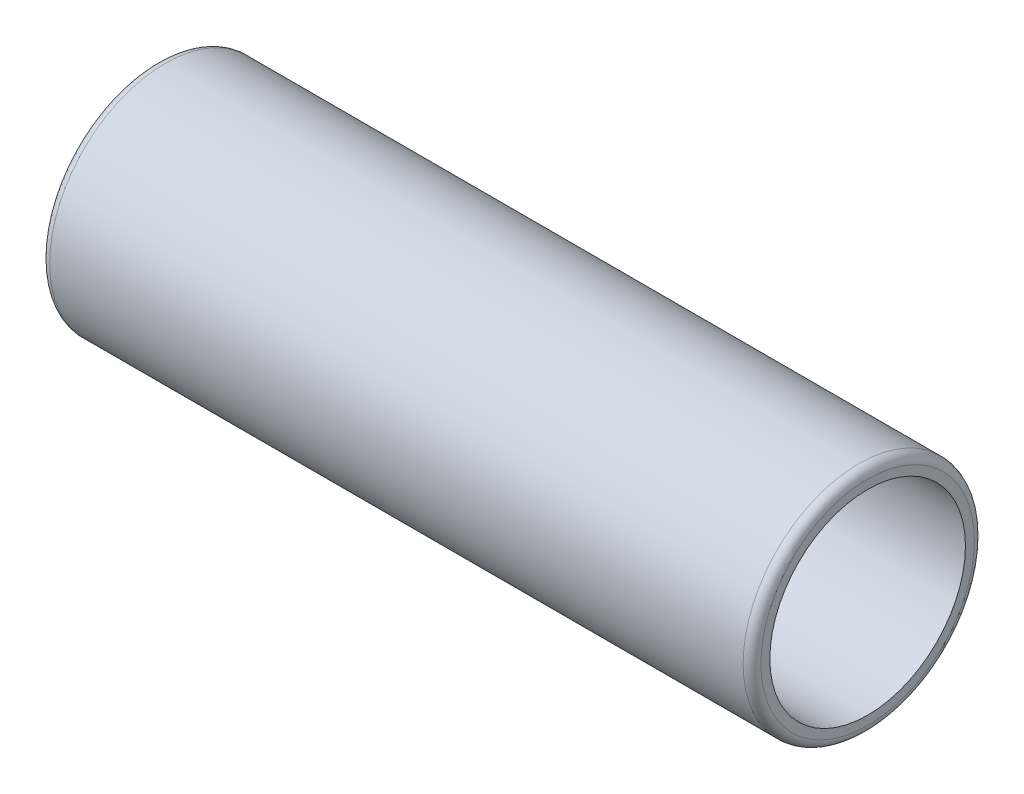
ISO-10303-21;
HEADER;
FILE_DESCRIPTION(('STEP AP214'),'2;1');
FILE_NAME('part.step','',(''),(''),'','','');
FILE_SCHEMA(('AUTOMOTIVE_DESIGN { 1 0 10303 214 1 1 1 1 }'));
ENDSEC;
DATA;
#1=APPLICATION_CONTEXT('core data for automotive mechanical design processes');
#2=APPLICATION_PROTOCOL_DEFINITION('international standard','automotive_design',2000,#1);
#3=PRODUCT_CONTEXT('',#1,'mechanical');
#4=PRODUCT('Part','Part','',(#3));
#5=PRODUCT_RELATED_PRODUCT_CATEGORY('part','',(#4));
#6=PRODUCT_DEFINITION_FORMATION('','',#4);
#7=PRODUCT_DEFINITION_CONTEXT('part definition',#1,'design');
#8=PRODUCT_DEFINITION('design','',#6,#7);
#9=PRODUCT_DEFINITION_SHAPE('','',#8);
#10=(LENGTH_UNIT() NAMED_UNIT(*) SI_UNIT(.MILLI.,.METRE.));
#11=(NAMED_UNIT(*) PLANE_ANGLE_UNIT() SI_UNIT($,.RADIAN.));
#12=(NAMED_UNIT(*) SI_UNIT($,.STERADIAN.) SOLID_ANGLE_UNIT());
#13=UNCERTAINTY_MEASURE_WITH_UNIT(LENGTH_MEASURE(1.E-05),#10,'distance_accuracy_value','');
#14=(GEOMETRIC_REPRESENTATION_CONTEXT(3) GLOBAL_UNCERTAINTY_ASSIGNED_CONTEXT((#13)) GLOBAL_UNIT_ASSIGNED_CONTEXT((#10,
#11,#12)) REPRESENTATION_CONTEXT('',''));
#15=CARTESIAN_POINT('',(0.,0.,0.));
#16=DIRECTION('',(0.,0.,1.));
#17=DIRECTION('',(1.,0.,0.));
#18=AXIS2_PLACEMENT_3D('',#15,#16,#17);
#19=CARTESIAN_POINT('',(0.,0.,0.));
#20=DIRECTION('',(-1.,0.,0.));
#21=DIRECTION('',(0.,0.,1.));
#22=AXIS2_PLACEMENT_3D('',#19,#20,#21);
#23=CYLINDRICAL_SURFACE('',#22,6.);
#24=CARTESIAN_POINT('',(8.,0.,0.));
#25=DIRECTION('',(-1.,0.,0.));
#26=DIRECTION('',(0.,0.,1.));
#27=AXIS2_PLACEMENT_3D('',#24,#25,#26);
#28=CIRCLE('',#27,6.);
#29=CARTESIAN_POINT('',(8.,0.,6.));
#30=VERTEX_POINT('',#29);
#31=EDGE_CURVE('E43',#30,#30,#28,.T.);
#32=ORIENTED_EDGE('',*,*,#31,.F.);
#33=EDGE_LOOP('',(#32));
#34=FACE_BOUND('',#33,.T.);
#35=CARTESIAN_POINT('',(0.,0.,0.));
#36=DIRECTION('',(-1.,0.,0.));
#37=DIRECTION('',(0.,0.,1.));
#38=AXIS2_PLACEMENT_3D('',#35,#36,#37);
#39=CIRCLE('',#38,6.);
#40=CARTESIAN_POINT('',(0.,0.,6.));
#41=VERTEX_POINT('',#40);
#42=EDGE_CURVE('E34',#41,#41,#39,.T.);
#43=ORIENTED_EDGE('',*,*,#42,.T.);
#44=EDGE_LOOP('',(#43));
#45=FACE_BOUND('',#44,.T.);
#46=ADVANCED_FACE('F14',(#34,#45),#23,.F.);
#47=CARTESIAN_POINT('',(0.,6.,0.));
#48=DIRECTION('',(1.,0.,0.));
#49=DIRECTION('',(0.,0.,-1.));
#50=AXIS2_PLACEMENT_3D('',#47,#48,#49);
#51=PLANE('',#50);
#52=CARTESIAN_POINT('',(0.,0.,0.));
#53=DIRECTION('',(1.,0.,0.));
#54=DIRECTION('',(0.,0.,-1.));
#55=AXIS2_PLACEMENT_3D('',#52,#53,#54);
#56=CIRCLE('',#55,12.);
#57=CARTESIAN_POINT('',(0.,0.,-12.));
#58=VERTEX_POINT('',#57);
#59=EDGE_CURVE('E21',#58,#58,#56,.F.);
#60=ORIENTED_EDGE('',*,*,#59,.T.);
#61=EDGE_LOOP('',(#60));
#62=FACE_BOUND('',#61,.T.);
#63=ORIENTED_EDGE('',*,*,#42,.F.);
#64=EDGE_LOOP('',(#63));
#65=FACE_BOUND('',#64,.T.);
#66=ADVANCED_FACE('F51',(#62,#65),#51,.F.);
#67=CARTESIAN_POINT('',(0.,0.,0.));
#68=DIRECTION('',(-1.,0.,0.));
#69=DIRECTION('',(0.,0.,1.));
#70=AXIS2_PLACEMENT_3D('',#67,#68,#69);
#71=CYLINDRICAL_SURFACE('',#70,13.);
#72=CARTESIAN_POINT('',(1.,0.,0.));
#73=DIRECTION('',(1.,0.,0.));
#74=DIRECTION('',(0.,0.,-1.));
#75=AXIS2_PLACEMENT_3D('',#72,#73,#74);
#76=CIRCLE('',#75,13.);
#77=CARTESIAN_POINT('',(1.,0.,-13.));
#78=VERTEX_POINT('',#77);
#79=EDGE_CURVE('E9',#78,#78,#76,.T.);
#80=ORIENTED_EDGE('',*,*,#79,.T.);
#81=EDGE_LOOP('',(#80));
#82=FACE_BOUND('',#81,.T.);
#83=CARTESIAN_POINT('',(79.,0.,0.));
#84=DIRECTION('',(-1.,0.,0.));
#85=DIRECTION('',(0.,0.,1.));
#86=AXIS2_PLACEMENT_3D('',#83,#84,#85);
#87=CIRCLE('',#86,13.);
#88=CARTESIAN_POINT('',(79.,0.,13.));
#89=VERTEX_POINT('',#88);
#90=EDGE_CURVE('E29',#89,#89,#87,.T.);
#91=ORIENTED_EDGE('',*,*,#90,.T.);
#92=EDGE_LOOP('',(#91));
#93=FACE_BOUND('',#92,.T.);
#94=ADVANCED_FACE('F56',(#82,#93),#71,.T.);
#95=CARTESIAN_POINT('',(80.,13.,0.));
#96=DIRECTION('',(-1.,0.,0.));
#97=DIRECTION('',(0.,0.,1.));
#98=AXIS2_PLACEMENT_3D('',#95,#96,#97);
#99=PLANE('',#98);
#100=CARTESIAN_POINT('',(80.,0.,0.));
#101=DIRECTION('',(-1.,0.,0.));
#102=DIRECTION('',(0.,0.,1.));
#103=AXIS2_PLACEMENT_3D('',#100,#101,#102);
#104=CIRCLE('',#103,12.);
#105=CARTESIAN_POINT('',(80.,0.,12.));
#106=VERTEX_POINT('',#105);
#107=EDGE_CURVE('E25',#106,#106,#104,.F.);
#108=ORIENTED_EDGE('',*,*,#107,.T.);
#109=EDGE_LOOP('',(#108));
#110=FACE_BOUND('',#109,.T.);
#111=CARTESIAN_POINT('',(80.,0.,0.));
#112=DIRECTION('',(-1.,0.,0.));
#113=DIRECTION('',(0.,0.,1.));
#114=AXIS2_PLACEMENT_3D('',#111,#112,#113);
#115=CIRCLE('',#114,11.);
#116=CARTESIAN_POINT('',(80.,0.,11.));
#117=VERTEX_POINT('',#116);
#118=EDGE_CURVE('E37',#117,#117,#115,.T.);
#119=ORIENTED_EDGE('',*,*,#118,.T.);
#120=EDGE_LOOP('',(#119));
#121=FACE_BOUND('',#120,.T.);
#122=ADVANCED_FACE('F63',(#110,#121),#99,.F.);
#123=CARTESIAN_POINT('',(0.,0.,0.));
#124=DIRECTION('',(-1.,0.,0.));
#125=DIRECTION('',(0.,0.,1.));
#126=AXIS2_PLACEMENT_3D('',#123,#124,#125);
#127=CYLINDRICAL_SURFACE('',#126,11.);
#128=ORIENTED_EDGE('',*,*,#118,.F.);
#129=EDGE_LOOP('',(#128));
#130=FACE_BOUND('',#129,.T.);
#131=CARTESIAN_POINT('',(13.,0.,0.));
#132=DIRECTION('',(-1.,0.,0.));
#133=DIRECTION('',(0.,0.,1.));
#134=AXIS2_PLACEMENT_3D('',#131,#132,#133);
#135=CIRCLE('',#134,11.);
#136=CARTESIAN_POINT('',(13.,0.,11.));
#137=VERTEX_POINT('',#136);
#138=EDGE_CURVE('E40',#137,#137,#135,.T.);
#139=ORIENTED_EDGE('',*,*,#138,.T.);
#140=EDGE_LOOP('',(#139));
#141=FACE_BOUND('',#140,.T.);
#142=ADVANCED_FACE('F75',(#130,#141),#127,.F.);
#143=CARTESIAN_POINT('',(8.,0.,0.));
#144=DIRECTION('',(1.,0.,0.));
#145=DIRECTION('',(0.,0.,-1.));
#146=AXIS2_PLACEMENT_3D('',#143,#144,#145);
#147=CONICAL_SURFACE('',#146,6.,0.785398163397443);
#148=ORIENTED_EDGE('',*,*,#138,.F.);
#149=EDGE_LOOP('',(#148));
#150=FACE_BOUND('',#149,.T.);
#151=ORIENTED_EDGE('',*,*,#31,.T.);
#152=EDGE_LOOP('',(#151));
#153=FACE_BOUND('',#152,.T.);
#154=ADVANCED_FACE('F47',(#150,#153),#147,.F.);
#155=CARTESIAN_POINT('',(79.,0.,0.));
#156=DIRECTION('',(-1.,0.,0.));
#157=DIRECTION('',(0.,0.,1.));
#158=AXIS2_PLACEMENT_3D('',#155,#156,#157);
#159=TOROIDAL_SURFACE('',#158,12.,1.);
#160=ORIENTED_EDGE('',*,*,#107,.F.);
#161=EDGE_LOOP('',(#160));
#162=FACE_BOUND('',#161,.T.);
#163=ORIENTED_EDGE('',*,*,#90,.F.);
#164=EDGE_LOOP('',(#163));
#165=FACE_BOUND('',#164,.T.);
#166=ADVANCED_FACE('F66',(#162,#165),#159,.T.);
#167=CARTESIAN_POINT('',(1.,0.,0.));
#168=DIRECTION('',(1.,0.,0.));
#169=DIRECTION('',(0.,0.,-1.));
#170=AXIS2_PLACEMENT_3D('',#167,#168,#169);
#171=TOROIDAL_SURFACE('',#170,12.,1.);
#172=ORIENTED_EDGE('',*,*,#79,.F.);
#173=EDGE_LOOP('',(#172));
#174=FACE_BOUND('',#173,.T.);
#175=ORIENTED_EDGE('',*,*,#59,.F.);
#176=EDGE_LOOP('',(#175));
#177=FACE_BOUND('',#176,.T.);
#178=ADVANCED_FACE('F16',(#174,#177),#171,.T.);
#179=CLOSED_SHELL('',(#46,#66,#94,#122,#142,#154,#166,#178));
#180=MANIFOLD_SOLID_BREP('B1',#179);
#181=ADVANCED_BREP_SHAPE_REPRESENTATION('',(#18,#180),#14);
#182=SHAPE_DEFINITION_REPRESENTATION(#9,#181);
ENDSEC;
END-ISO-10303-21;
